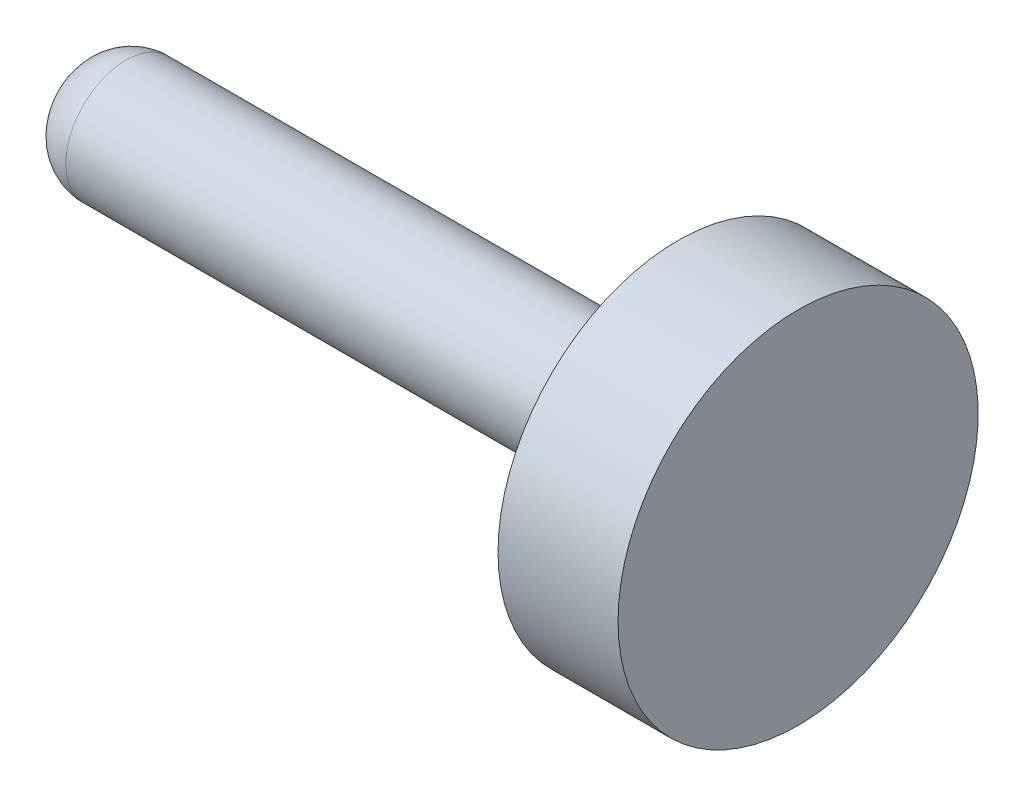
ISO-10303-21;
HEADER;
FILE_DESCRIPTION(('STEP AP214'),'2;1');
FILE_NAME('part.step','',(''),(''),'','','');
FILE_SCHEMA(('AUTOMOTIVE_DESIGN { 1 0 10303 214 1 1 1 1 }'));
ENDSEC;
DATA;
#1=APPLICATION_CONTEXT('core data for automotive mechanical design processes');
#2=APPLICATION_PROTOCOL_DEFINITION('international standard','automotive_design',2000,#1);
#3=PRODUCT_CONTEXT('',#1,'mechanical');
#4=PRODUCT('Part','Part','',(#3));
#5=PRODUCT_RELATED_PRODUCT_CATEGORY('part','',(#4));
#6=PRODUCT_DEFINITION_FORMATION('','',#4);
#7=PRODUCT_DEFINITION_CONTEXT('part definition',#1,'design');
#8=PRODUCT_DEFINITION('design','',#6,#7);
#9=PRODUCT_DEFINITION_SHAPE('','',#8);
#10=(LENGTH_UNIT() NAMED_UNIT(*) SI_UNIT(.MILLI.,.METRE.));
#11=(NAMED_UNIT(*) PLANE_ANGLE_UNIT() SI_UNIT($,.RADIAN.));
#12=(NAMED_UNIT(*) SI_UNIT($,.STERADIAN.) SOLID_ANGLE_UNIT());
#13=UNCERTAINTY_MEASURE_WITH_UNIT(LENGTH_MEASURE(1.E-05),#10,'distance_accuracy_value','');
#14=(GEOMETRIC_REPRESENTATION_CONTEXT(3) GLOBAL_UNCERTAINTY_ASSIGNED_CONTEXT((#13)) GLOBAL_UNIT_ASSIGNED_CONTEXT((#10,
#11,#12)) REPRESENTATION_CONTEXT('',''));
#15=CARTESIAN_POINT('',(0.,0.,0.));
#16=DIRECTION('',(0.,0.,1.));
#17=DIRECTION('',(1.,0.,0.));
#18=AXIS2_PLACEMENT_3D('',#15,#16,#17);
#19=CARTESIAN_POINT('',(0.,0.,0.));
#20=DIRECTION('',(-1.,0.,0.));
#21=DIRECTION('',(0.,0.,1.));
#22=AXIS2_PLACEMENT_3D('',#19,#20,#21);
#23=PLANE('',#22);
#24=CARTESIAN_POINT('',(0.,0.,0.));
#25=DIRECTION('',(-1.,0.,0.));
#26=DIRECTION('',(0.,0.,1.));
#27=AXIS2_PLACEMENT_3D('',#24,#25,#26);
#28=CIRCLE('',#27,3.);
#29=CARTESIAN_POINT('',(0.,0.,3.));
#30=VERTEX_POINT('',#29);
#31=EDGE_CURVE('E39',#30,#30,#28,.T.);
#32=ORIENTED_EDGE('',*,*,#31,.F.);
#33=EDGE_LOOP('',(#32));
#34=FACE_BOUND('',#33,.T.);
#35=ADVANCED_FACE('F28',(#34),#23,.F.);
#36=CARTESIAN_POINT('',(-12.,0.,0.));
#37=DIRECTION('',(-1.,0.,0.));
#38=DIRECTION('',(0.,0.,1.));
#39=AXIS2_PLACEMENT_3D('',#36,#37,#38);
#40=CYLINDRICAL_SURFACE('',#39,3.);
#41=CARTESIAN_POINT('',(-2.,0.,0.));
#42=DIRECTION('',(-1.,0.,0.));
#43=DIRECTION('',(0.,0.,1.));
#44=AXIS2_PLACEMENT_3D('',#41,#42,#43);
#45=CIRCLE('',#44,3.);
#46=CARTESIAN_POINT('',(-2.,0.,3.));
#47=VERTEX_POINT('',#46);
#48=EDGE_CURVE('E43',#47,#47,#45,.T.);
#49=ORIENTED_EDGE('',*,*,#48,.F.);
#50=EDGE_LOOP('',(#49));
#51=FACE_BOUND('',#50,.T.);
#52=ORIENTED_EDGE('',*,*,#31,.T.);
#53=EDGE_LOOP('',(#52));
#54=FACE_BOUND('',#53,.T.);
#55=ADVANCED_FACE('F57',(#51,#54),#40,.T.);
#56=CARTESIAN_POINT('',(-2.,3.,0.));
#57=DIRECTION('',(1.,0.,0.));
#58=DIRECTION('',(0.,0.,-1.));
#59=AXIS2_PLACEMENT_3D('',#56,#57,#58);
#60=PLANE('',#59);
#61=CARTESIAN_POINT('',(-2.,0.,0.));
#62=DIRECTION('',(-1.,0.,0.));
#63=DIRECTION('',(0.,0.,1.));
#64=AXIS2_PLACEMENT_3D('',#61,#62,#63);
#65=CIRCLE('',#64,1.00000000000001);
#66=CARTESIAN_POINT('',(-2.,0.,1.00000000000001));
#67=VERTEX_POINT('',#66);
#68=EDGE_CURVE('E48',#67,#67,#65,.T.);
#69=ORIENTED_EDGE('',*,*,#68,.F.);
#70=EDGE_LOOP('',(#69));
#71=FACE_BOUND('',#70,.T.);
#72=ORIENTED_EDGE('',*,*,#48,.T.);
#73=EDGE_LOOP('',(#72));
#74=FACE_BOUND('',#73,.T.);
#75=ADVANCED_FACE('F54',(#71,#74),#60,.F.);
#76=CARTESIAN_POINT('',(-12.,0.,0.));
#77=DIRECTION('',(-1.,0.,0.));
#78=DIRECTION('',(0.,0.,1.));
#79=AXIS2_PLACEMENT_3D('',#76,#77,#78);
#80=CYLINDRICAL_SURFACE('',#79,1.);
#81=CARTESIAN_POINT('',(-11.2,0.,0.));
#82=DIRECTION('',(1.,0.,0.));
#83=DIRECTION('',(0.,0.,-1.));
#84=AXIS2_PLACEMENT_3D('',#81,#82,#83);
#85=CIRCLE('',#84,1.);
#86=CARTESIAN_POINT('',(-11.2,0.,-1.));
#87=VERTEX_POINT('',#86);
#88=EDGE_CURVE('E10',#87,#87,#85,.T.);
#89=ORIENTED_EDGE('',*,*,#88,.T.);
#90=EDGE_LOOP('',(#89));
#91=FACE_BOUND('',#90,.T.);
#92=ORIENTED_EDGE('',*,*,#68,.T.);
#93=EDGE_LOOP('',(#92));
#94=FACE_BOUND('',#93,.T.);
#95=ADVANCED_FACE('F52',(#91,#94),#80,.T.);
#96=CARTESIAN_POINT('',(-12.,1.,0.));
#97=DIRECTION('',(1.,0.,0.));
#98=DIRECTION('',(0.,0.,-1.));
#99=AXIS2_PLACEMENT_3D('',#96,#97,#98);
#100=PLANE('',#99);
#101=CARTESIAN_POINT('',(-12.,0.,0.));
#102=DIRECTION('',(1.,0.,0.));
#103=DIRECTION('',(0.,0.,-1.));
#104=AXIS2_PLACEMENT_3D('',#101,#102,#103);
#105=CIRCLE('',#104,0.200000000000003);
#106=CARTESIAN_POINT('',(-12.,0.,-0.200000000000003));
#107=VERTEX_POINT('',#106);
#108=EDGE_CURVE('E35',#107,#107,#105,.F.);
#109=ORIENTED_EDGE('',*,*,#108,.T.);
#110=EDGE_LOOP('',(#109));
#111=FACE_BOUND('',#110,.T.);
#112=ADVANCED_FACE('F72',(#111),#100,.F.);
#113=CARTESIAN_POINT('',(-11.2,0.,0.));
#114=DIRECTION('',(1.,0.,0.));
#115=DIRECTION('',(0.,0.,-1.));
#116=AXIS2_PLACEMENT_3D('',#113,#114,#115);
#117=DEGENERATE_TOROIDAL_SURFACE('',#116,0.200000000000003,0.8,.T.);
#118=ORIENTED_EDGE('',*,*,#88,.F.);
#119=EDGE_LOOP('',(#118));
#120=FACE_BOUND('',#119,.T.);
#121=ORIENTED_EDGE('',*,*,#108,.F.);
#122=EDGE_LOOP('',(#121));
#123=FACE_BOUND('',#122,.T.);
#124=ADVANCED_FACE('F30',(#120,#123),#117,.T.);
#125=CLOSED_SHELL('',(#35,#55,#75,#95,#112,#124));
#126=MANIFOLD_SOLID_BREP('B2',#125);
#127=ADVANCED_BREP_SHAPE_REPRESENTATION('',(#18,#126),#14);
#128=SHAPE_DEFINITION_REPRESENTATION(#9,#127);
ENDSEC;
END-ISO-10303-21;
